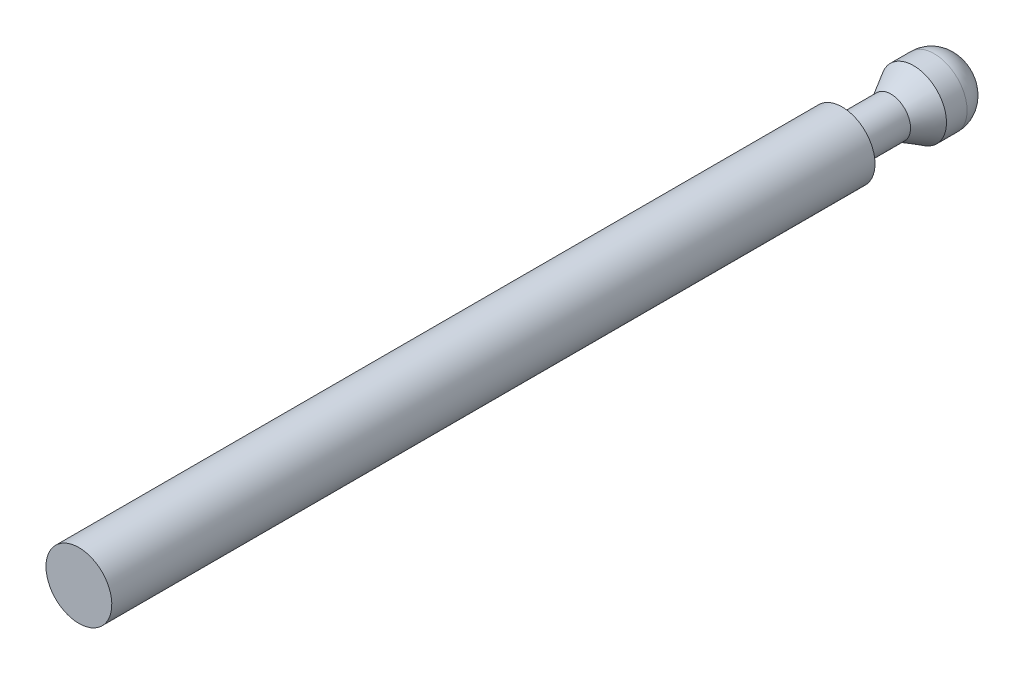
ISO-10303-21;
HEADER;
FILE_DESCRIPTION(('STEP AP214'),'2;1');
FILE_NAME('part.step','',(''),(''),'','','');
FILE_SCHEMA(('AUTOMOTIVE_DESIGN { 1 0 10303 214 1 1 1 1 }'));
ENDSEC;
DATA;
#1=APPLICATION_CONTEXT('core data for automotive mechanical design processes');
#2=APPLICATION_PROTOCOL_DEFINITION('international standard','automotive_design',2000,#1);
#3=PRODUCT_CONTEXT('',#1,'mechanical');
#4=PRODUCT('Part','Part','',(#3));
#5=PRODUCT_RELATED_PRODUCT_CATEGORY('part','',(#4));
#6=PRODUCT_DEFINITION_FORMATION('','',#4);
#7=PRODUCT_DEFINITION_CONTEXT('part definition',#1,'design');
#8=PRODUCT_DEFINITION('design','',#6,#7);
#9=PRODUCT_DEFINITION_SHAPE('','',#8);
#10=(LENGTH_UNIT() NAMED_UNIT(*) SI_UNIT(.MILLI.,.METRE.));
#11=(NAMED_UNIT(*) PLANE_ANGLE_UNIT() SI_UNIT($,.RADIAN.));
#12=(NAMED_UNIT(*) SI_UNIT($,.STERADIAN.) SOLID_ANGLE_UNIT());
#13=UNCERTAINTY_MEASURE_WITH_UNIT(LENGTH_MEASURE(1.E-05),#10,'distance_accuracy_value','');
#14=(GEOMETRIC_REPRESENTATION_CONTEXT(3) GLOBAL_UNCERTAINTY_ASSIGNED_CONTEXT((#13)) GLOBAL_UNIT_ASSIGNED_CONTEXT((#10,
#11,#12)) REPRESENTATION_CONTEXT('',''));
#15=CARTESIAN_POINT('',(0.,0.,0.));
#16=DIRECTION('',(0.,0.,1.));
#17=DIRECTION('',(1.,0.,0.));
#18=AXIS2_PLACEMENT_3D('',#15,#16,#17);
#19=CARTESIAN_POINT('',(0.,0.,-50.));
#20=DIRECTION('',(0.,0.,-1.));
#21=DIRECTION('',(0.,-1.,0.));
#22=AXIS2_PLACEMENT_3D('',#19,#20,#21);
#23=CYLINDRICAL_SURFACE('',#22,1.5);
#24=CARTESIAN_POINT('',(0.,0.,-58.));
#25=DIRECTION('',(0.,0.,-1.));
#26=DIRECTION('',(0.,-1.,0.));
#27=AXIS2_PLACEMENT_3D('',#24,#25,#26);
#28=CIRCLE('',#27,1.5);
#29=CARTESIAN_POINT('',(0.,-1.5,-58.));
#30=VERTEX_POINT('',#29);
#31=EDGE_CURVE('E34',#30,#30,#28,.T.);
#32=ORIENTED_EDGE('',*,*,#31,.T.);
#33=EDGE_LOOP('',(#32));
#34=FACE_BOUND('',#33,.T.);
#35=CARTESIAN_POINT('',(0.,0.,-61.7));
#36=DIRECTION('',(0.,0.,-1.));
#37=DIRECTION('',(0.,-1.,0.));
#38=AXIS2_PLACEMENT_3D('',#35,#36,#37);
#39=CIRCLE('',#38,1.5);
#40=CARTESIAN_POINT('',(0.,-1.5,-61.7));
#41=VERTEX_POINT('',#40);
#42=EDGE_CURVE('E22',#41,#41,#39,.T.);
#43=ORIENTED_EDGE('',*,*,#42,.F.);
#44=EDGE_LOOP('',(#43));
#45=FACE_BOUND('',#44,.T.);
#46=ADVANCED_FACE('F12',(#34,#45),#23,.T.);
#47=CARTESIAN_POINT('',(0.,0.,-63.4320508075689));
#48=DIRECTION('',(0.,0.,-1.));
#49=DIRECTION('',(0.,-1.,0.));
#50=AXIS2_PLACEMENT_3D('',#47,#48,#49);
#51=CONICAL_SURFACE('',#50,2.5,0.523598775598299);
#52=ORIENTED_EDGE('',*,*,#42,.T.);
#53=EDGE_LOOP('',(#52));
#54=FACE_BOUND('',#53,.T.);
#55=CARTESIAN_POINT('',(0.,0.,-63.4320508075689));
#56=DIRECTION('',(0.,0.,-1.));
#57=DIRECTION('',(0.,-1.,0.));
#58=AXIS2_PLACEMENT_3D('',#55,#56,#57);
#59=CIRCLE('',#58,2.5);
#60=CARTESIAN_POINT('',(0.,-2.5,-63.4320508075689));
#61=VERTEX_POINT('',#60);
#62=EDGE_CURVE('E26',#61,#61,#59,.T.);
#63=ORIENTED_EDGE('',*,*,#62,.F.);
#64=EDGE_LOOP('',(#63));
#65=FACE_BOUND('',#64,.T.);
#66=ADVANCED_FACE('F62',(#54,#65),#51,.T.);
#67=CARTESIAN_POINT('',(0.,0.,-50.));
#68=DIRECTION('',(0.,0.,-1.));
#69=DIRECTION('',(0.,-1.,0.));
#70=AXIS2_PLACEMENT_3D('',#67,#68,#69);
#71=CYLINDRICAL_SURFACE('',#70,2.5);
#72=CARTESIAN_POINT('',(0.,0.,-65.));
#73=DIRECTION('',(0.,0.,-1.));
#74=DIRECTION('',(0.,-1.,0.));
#75=AXIS2_PLACEMENT_3D('',#72,#73,#74);
#76=CIRCLE('',#75,2.5);
#77=CARTESIAN_POINT('',(0.,-2.5,-65.));
#78=VERTEX_POINT('',#77);
#79=EDGE_CURVE('E8',#78,#78,#76,.F.);
#80=ORIENTED_EDGE('',*,*,#79,.T.);
#81=EDGE_LOOP('',(#80));
#82=FACE_BOUND('',#81,.T.);
#83=ORIENTED_EDGE('',*,*,#62,.T.);
#84=EDGE_LOOP('',(#83));
#85=FACE_BOUND('',#84,.T.);
#86=ADVANCED_FACE('F58',(#82,#85),#71,.T.);
#87=CARTESIAN_POINT('',(-2.5,0.,-67.));
#88=DIRECTION('',(0.,0.,-1.));
#89=DIRECTION('',(0.,-1.,0.));
#90=AXIS2_PLACEMENT_3D('',#87,#88,#89);
#91=PLANE('',#90);
#92=CARTESIAN_POINT('',(0.,0.,-67.));
#93=DIRECTION('',(0.,0.,-1.));
#94=DIRECTION('',(0.,-1.,0.));
#95=AXIS2_PLACEMENT_3D('',#92,#93,#94);
#96=CIRCLE('',#95,0.5);
#97=CARTESIAN_POINT('',(0.,-0.499999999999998,-67.));
#98=VERTEX_POINT('',#97);
#99=EDGE_CURVE('E18',#98,#98,#96,.T.);
#100=ORIENTED_EDGE('',*,*,#99,.T.);
#101=EDGE_LOOP('',(#100));
#102=FACE_BOUND('',#101,.T.);
#103=ADVANCED_FACE('F46',(#102),#91,.T.);
#104=CARTESIAN_POINT('',(0.,0.,-50.));
#105=DIRECTION('',(0.,0.,-1.));
#106=DIRECTION('',(0.,-1.,0.));
#107=AXIS2_PLACEMENT_3D('',#104,#105,#106);
#108=CYLINDRICAL_SURFACE('',#107,2.5);
#109=CARTESIAN_POINT('',(0.,0.,-58.));
#110=DIRECTION('',(0.,0.,-1.));
#111=DIRECTION('',(0.,-1.,0.));
#112=AXIS2_PLACEMENT_3D('',#109,#110,#111);
#113=CIRCLE('',#112,2.5);
#114=CARTESIAN_POINT('',(0.,-2.5,-58.));
#115=VERTEX_POINT('',#114);
#116=EDGE_CURVE('E31',#115,#115,#113,.T.);
#117=ORIENTED_EDGE('',*,*,#116,.F.);
#118=EDGE_LOOP('',(#117));
#119=FACE_BOUND('',#118,.T.);
#120=CARTESIAN_POINT('',(0.,0.,0.));
#121=DIRECTION('',(0.,0.,-1.));
#122=DIRECTION('',(-1.,0.,0.));
#123=AXIS2_PLACEMENT_3D('',#120,#121,#122);
#124=CIRCLE('',#123,2.5);
#125=CARTESIAN_POINT('',(-2.5,0.,0.));
#126=VERTEX_POINT('',#125);
#127=EDGE_CURVE('E37',#126,#126,#124,.F.);
#128=ORIENTED_EDGE('',*,*,#127,.F.);
#129=EDGE_LOOP('',(#128));
#130=FACE_BOUND('',#129,.T.);
#131=ADVANCED_FACE('F43',(#119,#130),#108,.T.);
#132=CARTESIAN_POINT('',(-2.5,0.,-58.));
#133=DIRECTION('',(0.,0.,-1.));
#134=DIRECTION('',(0.,-1.,0.));
#135=AXIS2_PLACEMENT_3D('',#132,#133,#134);
#136=PLANE('',#135);
#137=ORIENTED_EDGE('',*,*,#116,.T.);
#138=EDGE_LOOP('',(#137));
#139=FACE_BOUND('',#138,.T.);
#140=ORIENTED_EDGE('',*,*,#31,.F.);
#141=EDGE_LOOP('',(#140));
#142=FACE_BOUND('',#141,.T.);
#143=ADVANCED_FACE('F45',(#139,#142),#136,.T.);
#144=CARTESIAN_POINT('',(0.,0.,-65.));
#145=DIRECTION('',(0.,0.,-1.));
#146=DIRECTION('',(0.,-1.,0.));
#147=AXIS2_PLACEMENT_3D('',#144,#145,#146);
#148=DEGENERATE_TOROIDAL_SURFACE('',#147,0.5,2.,.T.);
#149=ORIENTED_EDGE('',*,*,#79,.F.);
#150=EDGE_LOOP('',(#149));
#151=FACE_BOUND('',#150,.T.);
#152=ORIENTED_EDGE('',*,*,#99,.F.);
#153=EDGE_LOOP('',(#152));
#154=FACE_BOUND('',#153,.T.);
#155=ADVANCED_FACE('F55',(#151,#154),#148,.T.);
#156=CARTESIAN_POINT('',(0.,0.,0.));
#157=DIRECTION('',(0.,0.,-1.));
#158=DIRECTION('',(-1.,0.,0.));
#159=AXIS2_PLACEMENT_3D('',#156,#157,#158);
#160=PLANE('',#159);
#161=ORIENTED_EDGE('',*,*,#127,.T.);
#162=EDGE_LOOP('',(#161));
#163=FACE_BOUND('',#162,.T.);
#164=ADVANCED_FACE('F41',(#163),#160,.F.);
#165=CLOSED_SHELL('',(#46,#66,#86,#103,#131,#143,#155,#164));
#166=MANIFOLD_SOLID_BREP('B1',#165);
#167=ADVANCED_BREP_SHAPE_REPRESENTATION('',(#18,#166),#14);
#168=SHAPE_DEFINITION_REPRESENTATION(#9,#167);
ENDSEC;
END-ISO-10303-21;
